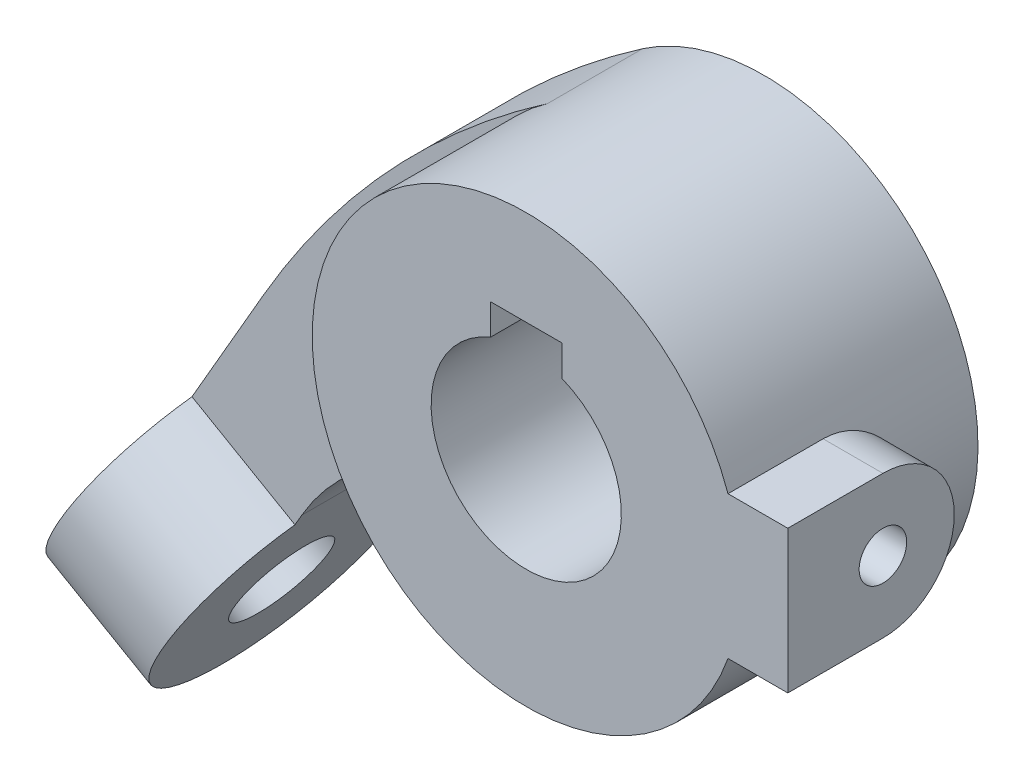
from build123d import *

# Parameters (mm, degrees)
SKETCH_1_R           = 18
EXTRUDE_1_DEPTH      = 20
EXTRUDE_2_REACH      = 50.208
EXTRUDE_2_END_RADIUS = 18
EXTRUDE_3_DEPTH      = 8
SKETCH_4_R           = 10
EXTRUDE_4_DEPTH      = 10
SKETCH_5_R           = 4
CUT_EXTRUDE_1_DEPTH  = 11
SKETCH_7_R           = 2
CUT_EXTRUDE_2_DEPTH  = 20


with BuildPart() as part:
    # Sketch 1 → Extrude 1 (new body)
    with BuildSketch(Plane.XY):
        Circle(SKETCH_1_R)
        with BuildLine():
            Line((-3, 7.416198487), (-3, 10))
            Line((-3, 10), (3, 10))
            Line((3, 10), (3, 7.416198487))
            ThreePointArc((3, 7.416198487), (0, -8), (-3, 7.416198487))
        make_face(mode=Mode.SUBTRACT)
    extrude(amount=EXTRUDE_1_DEPTH)

    # Extrude 2: up to this cylinder (the profile starts outside it)
    extrude_2_end = Plane(origin=(0, 0, 13.573268), z_dir=(0, 0, -1)) * Cylinder(EXTRUDE_2_END_RADIUS, 137.416, mode=Mode.PRIVATE)
    # Sketch 2 → Extrude 2 (add, up to the surface)
    with BuildSketch(Plane(origin=(22, 0, 0), x_dir=(0, 0, -1), z_dir=(1, 0, 0)), mode=Mode.PRIVATE) as extrude_2_sk1:
        with BuildLine():
            Line((-12, 6), (-20, 6))
            Line((-20, 6), (-20, -6))
            Line((-20, -6), (-12, -6))
            ThreePointArc((-12, -6), (-6, 0), (-12, 6))
        make_face()
    extrude_2_tool1 = extrude(extrude_2_sk1.sketch, amount=-EXTRUDE_2_REACH, mode=Mode.PRIVATE) - extrude_2_end
    add(extrude_2_tool1.solids().sort_by_distance((22, 0, 13.573268))[0])

    # Sketch 3 → Extrude 3 (add)
    with BuildSketch(Plane.XY):
        with BuildLine():
            Line((-34.088744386, -11.043437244), (-44.784609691, -29.569219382))
            Line((-44.784609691, -29.569219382), (-36.124355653, -34.569219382))
            Line((-36.124355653, -34.569219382), (-30.886018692, -25.496153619))
            ThreePointArc((-30.886018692, -25.496153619), (-20.255584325, -16.648264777), (-6.425768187, -16.813967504))
            ThreePointArc((-6.425768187, -16.813967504), (-17.872072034, -2.142204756), (-10.217406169, 14.819062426))
            ThreePointArc((-10.217406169, 14.819062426), (-23.592957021, 3.216837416), (-34.088744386, -11.043437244))
        make_face()
    extrude(amount=EXTRUDE_3_DEPTH)

    # Sketch 4 → Extrude 4 (add)
    with BuildSketch(Plane(origin=(-20.784609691, 12, 0), x_dir=(0, 0, 1), z_dir=(-0.8660254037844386, 0.5000000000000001, 0))):
        with Locations((4.443645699, -48)):
            Circle(SKETCH_4_R)
    extrude(amount=-EXTRUDE_4_DEPTH)

    # Sketch 5 → Cut-Extrude 1 (cut)
    with BuildSketch(Plane(origin=(-20.784609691, 12, 0), x_dir=(0, 0, 1), z_dir=(-0.8660254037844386, 0.5000000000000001, 0))):
        with Locations(Location((4.443645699, -48, 0), (0, 0, 270))):
            Circle(SKETCH_5_R)
    extrude(amount=-CUT_EXTRUDE_1_DEPTH, mode=Mode.SUBTRACT)

    # Sketch 7 → Cut-Extrude 2 (cut)
    with BuildSketch(Plane(origin=(22, 0, 0), x_dir=(0, 0, -1), z_dir=(1, 0, 0))):
        with Locations((-12, 0)):
            Circle(SKETCH_7_R)
    extrude(amount=-CUT_EXTRUDE_2_DEPTH, mode=Mode.SUBTRACT)


solid = part.part
